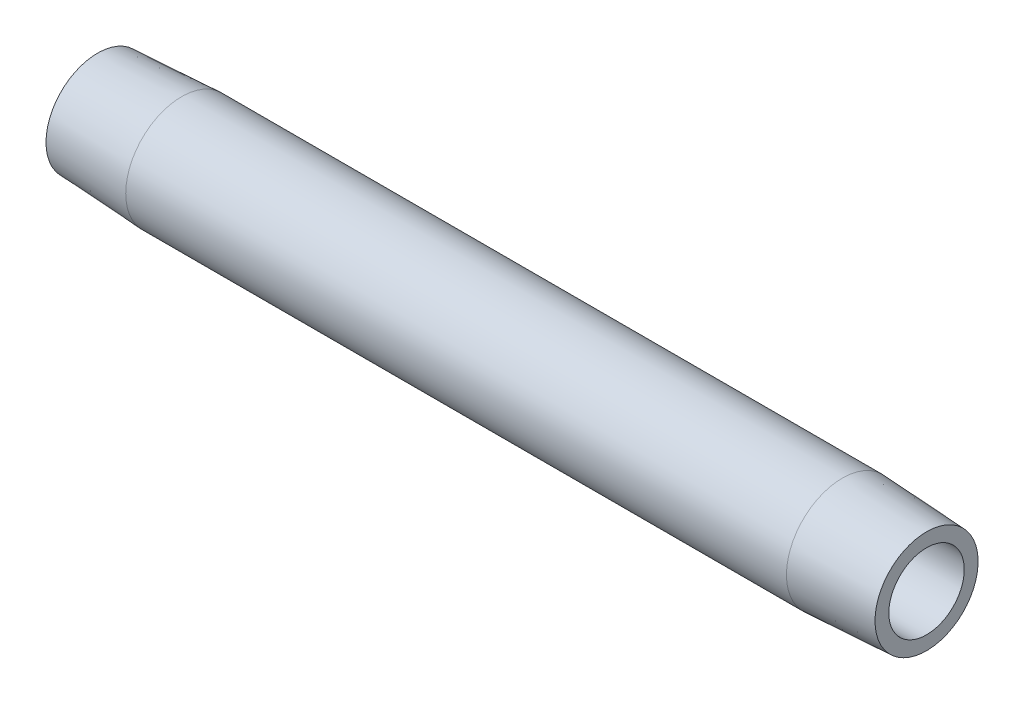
from build123d import *


with BuildPart() as part:
    # Sketch1 → Revolve1 (revolve)
    with BuildSketch(Plane(origin=(0, 0, 0), x_dir=(1, 0, 0), z_dir=(0, 1, 0)), mode=Mode.PRIVATE) as revolve1_sk:
        Polygon((101.6, 4.622776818), (0, 4.622776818), (0, 6.317526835), (10.3124, 6.857976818), (91.2876, 6.857976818), (101.6, 6.317526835), align=None)
    revolve(revolve1_sk.sketch.rotate(Axis((-6.375994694, 0, 0), (1, 0, 0)), 180), axis=Axis((-6.375994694, 0, 0), (1, 0, 0)))


solid = part.part
